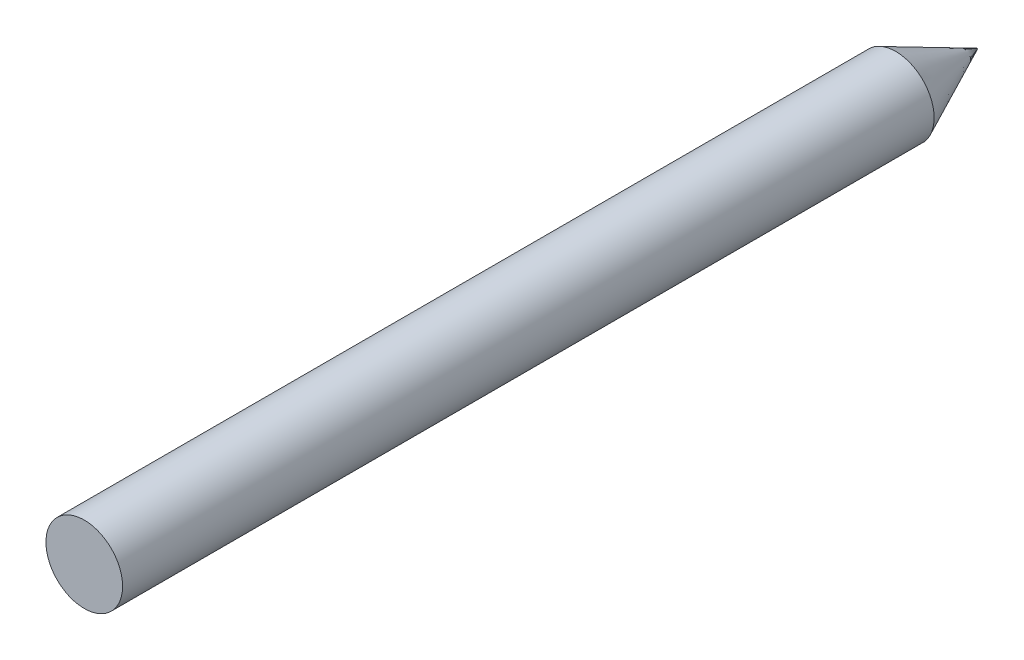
ISO-10303-21;
HEADER;
FILE_DESCRIPTION(('STEP AP214'),'2;1');
FILE_NAME('part.step','',(''),(''),'','','');
FILE_SCHEMA(('AUTOMOTIVE_DESIGN { 1 0 10303 214 1 1 1 1 }'));
ENDSEC;
DATA;
#1=APPLICATION_CONTEXT('core data for automotive mechanical design processes');
#2=APPLICATION_PROTOCOL_DEFINITION('international standard','automotive_design',2000,#1);
#3=PRODUCT_CONTEXT('',#1,'mechanical');
#4=PRODUCT('Part','Part','',(#3));
#5=PRODUCT_RELATED_PRODUCT_CATEGORY('part','',(#4));
#6=PRODUCT_DEFINITION_FORMATION('','',#4);
#7=PRODUCT_DEFINITION_CONTEXT('part definition',#1,'design');
#8=PRODUCT_DEFINITION('design','',#6,#7);
#9=PRODUCT_DEFINITION_SHAPE('','',#8);
#10=(LENGTH_UNIT() NAMED_UNIT(*) SI_UNIT(.MILLI.,.METRE.));
#11=(NAMED_UNIT(*) PLANE_ANGLE_UNIT() SI_UNIT($,.RADIAN.));
#12=(NAMED_UNIT(*) SI_UNIT($,.STERADIAN.) SOLID_ANGLE_UNIT());
#13=UNCERTAINTY_MEASURE_WITH_UNIT(LENGTH_MEASURE(1.E-05),#10,'distance_accuracy_value','');
#14=(GEOMETRIC_REPRESENTATION_CONTEXT(3) GLOBAL_UNCERTAINTY_ASSIGNED_CONTEXT((#13)) GLOBAL_UNIT_ASSIGNED_CONTEXT((#10,
#11,#12)) REPRESENTATION_CONTEXT('',''));
#15=CARTESIAN_POINT('',(0.,0.,0.));
#16=DIRECTION('',(0.,0.,1.));
#17=DIRECTION('',(1.,0.,0.));
#18=AXIS2_PLACEMENT_3D('',#15,#16,#17);
#19=CARTESIAN_POINT('',(0.,0.,-50.));
#20=DIRECTION('',(0.,0.,1.));
#21=DIRECTION('',(1.,0.,0.));
#22=AXIS2_PLACEMENT_3D('',#19,#20,#21);
#23=CYLINDRICAL_SURFACE('',#22,4.25);
#24=CARTESIAN_POINT('',(0.,0.,-50.));
#25=DIRECTION('',(0.,0.,-1.));
#26=DIRECTION('',(-1.,0.,0.));
#27=AXIS2_PLACEMENT_3D('',#24,#25,#26);
#28=CIRCLE('',#27,4.25);
#29=CARTESIAN_POINT('',(-4.25,0.,-50.));
#30=VERTEX_POINT('',#29);
#31=EDGE_CURVE('E40',#30,#30,#28,.T.);
#32=ORIENTED_EDGE('',*,*,#31,.F.);
#33=EDGE_LOOP('',(#32));
#34=FACE_BOUND('',#33,.T.);
#35=CARTESIAN_POINT('',(0.,0.,40.));
#36=DIRECTION('',(0.,0.,1.));
#37=DIRECTION('',(1.,0.,0.));
#38=AXIS2_PLACEMENT_3D('',#35,#36,#37);
#39=CIRCLE('',#38,4.25);
#40=CARTESIAN_POINT('',(4.25,0.,40.));
#41=VERTEX_POINT('',#40);
#42=EDGE_CURVE('E11',#41,#41,#39,.T.);
#43=ORIENTED_EDGE('',*,*,#42,.F.);
#44=EDGE_LOOP('',(#43));
#45=FACE_BOUND('',#44,.T.);
#46=ADVANCED_FACE('F34',(#34,#45),#23,.T.);
#47=CARTESIAN_POINT('',(0.,0.,40.));
#48=DIRECTION('',(0.,0.,1.));
#49=DIRECTION('',(1.,0.,0.));
#50=AXIS2_PLACEMENT_3D('',#47,#48,#49);
#51=PLANE('',#50);
#52=ORIENTED_EDGE('',*,*,#42,.T.);
#53=EDGE_LOOP('',(#52));
#54=FACE_BOUND('',#53,.T.);
#55=ADVANCED_FACE('F46',(#54),#51,.T.);
#56=CARTESIAN_POINT('',(0.,0.,-50.));
#57=DIRECTION('',(0.,0.,1.));
#58=DIRECTION('',(-1.,0.,0.));
#59=AXIS2_PLACEMENT_3D('',#56,#57,#58);
#60=CONICAL_SURFACE('',#59,4.25,0.436332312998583);
#61=CARTESIAN_POINT('',(0.,0.,-59.1141544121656));
#62=VERTEX_POINT('',#61);
#63=VERTEX_LOOP('',#62);
#64=FACE_BOUND('',#63,.T.);
#65=ORIENTED_EDGE('',*,*,#31,.T.);
#66=EDGE_LOOP('',(#65));
#67=FACE_BOUND('',#66,.T.);
#68=ADVANCED_FACE('F43',(#64,#67),#60,.T.);
#69=CLOSED_SHELL('',(#46,#55,#68));
#70=MANIFOLD_SOLID_BREP('B2',#69);
#71=ADVANCED_BREP_SHAPE_REPRESENTATION('',(#18,#70),#14);
#72=SHAPE_DEFINITION_REPRESENTATION(#9,#71);
ENDSEC;
END-ISO-10303-21;
